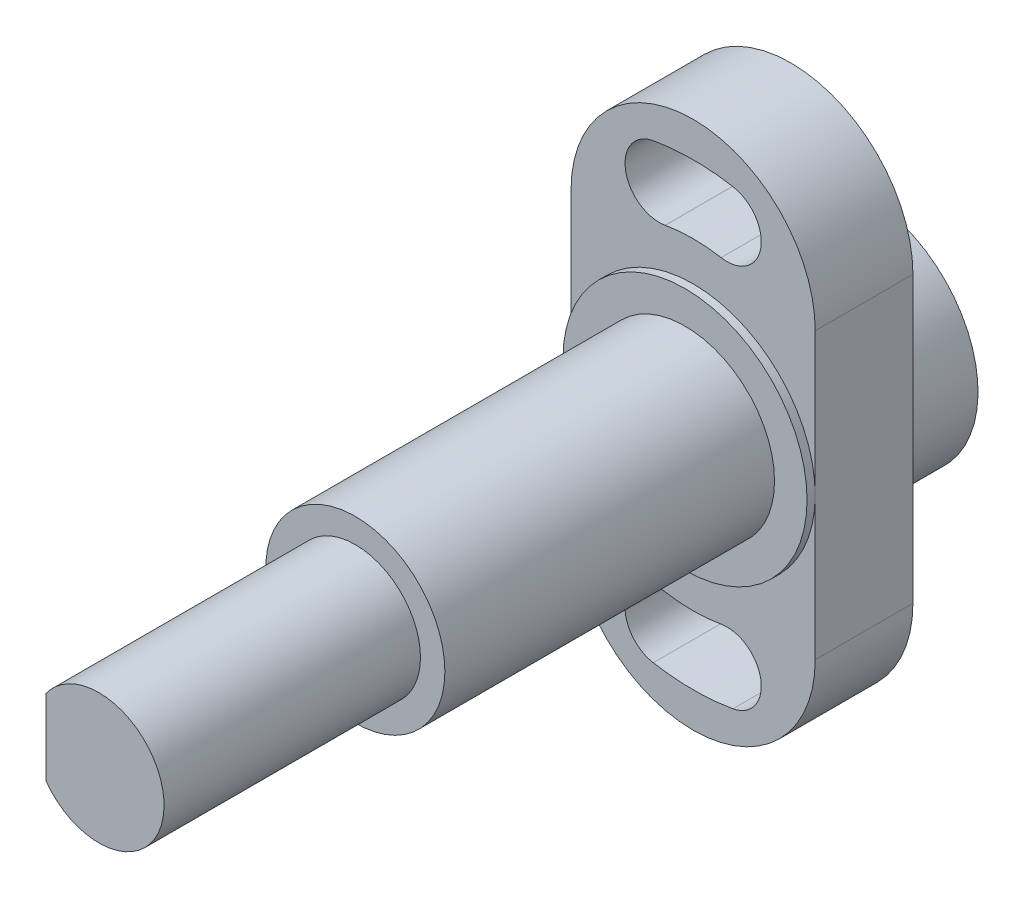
ISO-10303-21;
HEADER;
FILE_DESCRIPTION(('STEP AP214'),'2;1');
FILE_NAME('part.step','',(''),(''),'','','');
FILE_SCHEMA(('AUTOMOTIVE_DESIGN { 1 0 10303 214 1 1 1 1 }'));
ENDSEC;
DATA;
#1=APPLICATION_CONTEXT('core data for automotive mechanical design processes');
#2=APPLICATION_PROTOCOL_DEFINITION('international standard','automotive_design',2000,#1);
#3=PRODUCT_CONTEXT('',#1,'mechanical');
#4=PRODUCT('Part','Part','',(#3));
#5=PRODUCT_RELATED_PRODUCT_CATEGORY('part','',(#4));
#6=PRODUCT_DEFINITION_FORMATION('','',#4);
#7=PRODUCT_DEFINITION_CONTEXT('part definition',#1,'design');
#8=PRODUCT_DEFINITION('design','',#6,#7);
#9=PRODUCT_DEFINITION_SHAPE('','',#8);
#10=(LENGTH_UNIT() NAMED_UNIT(*) SI_UNIT(.MILLI.,.METRE.));
#11=(NAMED_UNIT(*) PLANE_ANGLE_UNIT() SI_UNIT($,.RADIAN.));
#12=(NAMED_UNIT(*) SI_UNIT($,.STERADIAN.) SOLID_ANGLE_UNIT());
#13=UNCERTAINTY_MEASURE_WITH_UNIT(LENGTH_MEASURE(1.E-05),#10,'distance_accuracy_value','');
#14=(GEOMETRIC_REPRESENTATION_CONTEXT(3) GLOBAL_UNCERTAINTY_ASSIGNED_CONTEXT((#13)) GLOBAL_UNIT_ASSIGNED_CONTEXT((#10,
#11,#12)) REPRESENTATION_CONTEXT('',''));
#15=CARTESIAN_POINT('',(0.,0.,0.));
#16=DIRECTION('',(0.,0.,1.));
#17=DIRECTION('',(1.,0.,0.));
#18=AXIS2_PLACEMENT_3D('',#15,#16,#17);
#19=CARTESIAN_POINT('',(0.,0.,-9.));
#20=DIRECTION('',(0.,0.,1.));
#21=DIRECTION('',(0.,-1.,0.));
#22=AXIS2_PLACEMENT_3D('',#19,#20,#21);
#23=CYLINDRICAL_SURFACE('',#22,28.2);
#24=DIRECTION('',(0.,0.,1.));
#25=VECTOR('',#24,1.);
#26=CARTESIAN_POINT('',(4.89687861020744,27.7715786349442,-9.));
#27=LINE('',#26,#25);
#28=CARTESIAN_POINT('',(4.89687861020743,27.7715786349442,0.));
#29=VERTEX_POINT('',#28);
#30=CARTESIAN_POINT('',(4.89687861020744,27.7715786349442,12.));
#31=VERTEX_POINT('',#30);
#32=EDGE_CURVE('E156',#29,#31,#27,.T.);
#33=ORIENTED_EDGE('',*,*,#32,.T.);
#34=CARTESIAN_POINT('',(0.,0.,12.));
#35=DIRECTION('',(0.,0.,1.));
#36=DIRECTION('',(0.,1.,0.));
#37=AXIS2_PLACEMENT_3D('',#34,#35,#36);
#38=CIRCLE('',#37,28.2);
#39=CARTESIAN_POINT('',(-4.89687861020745,27.7715786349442,12.));
#40=VERTEX_POINT('',#39);
#41=EDGE_CURVE('E230',#31,#40,#38,.T.);
#42=ORIENTED_EDGE('',*,*,#41,.T.);
#43=DIRECTION('',(0.,0.,1.));
#44=VECTOR('',#43,1.);
#45=CARTESIAN_POINT('',(-4.89687861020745,27.7715786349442,-9.));
#46=LINE('',#45,#44);
#47=CARTESIAN_POINT('',(-4.89687861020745,27.7715786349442,0.));
#48=VERTEX_POINT('',#47);
#49=EDGE_CURVE('E160',#48,#40,#46,.T.);
#50=ORIENTED_EDGE('',*,*,#49,.F.);
#51=CARTESIAN_POINT('',(0.,0.,0.));
#52=DIRECTION('',(0.,0.,1.));
#53=DIRECTION('',(-1.,0.,0.));
#54=AXIS2_PLACEMENT_3D('',#51,#52,#53);
#55=CIRCLE('',#54,28.2);
#56=EDGE_CURVE('E268',#29,#48,#55,.T.);
#57=ORIENTED_EDGE('',*,*,#56,.F.);
#58=EDGE_LOOP('',(#33,#42,#50,#57));
#59=FACE_BOUND('',#58,.T.);
#60=ADVANCED_FACE('F14',(#59),#23,.F.);
#61=CARTESIAN_POINT('',(-4.16755626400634,23.635386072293,-9.));
#62=DIRECTION('',(0.,0.,1.));
#63=DIRECTION('',(0.,-1.,0.));
#64=AXIS2_PLACEMENT_3D('',#61,#62,#63);
#65=CYLINDRICAL_SURFACE('',#64,4.2);
#66=ORIENTED_EDGE('',*,*,#49,.T.);
#67=CARTESIAN_POINT('',(-4.16755626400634,23.635386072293,12.));
#68=DIRECTION('',(0.,0.,1.));
#69=DIRECTION('',(0.,1.,0.));
#70=AXIS2_PLACEMENT_3D('',#67,#68,#69);
#71=CIRCLE('',#70,4.2);
#72=CARTESIAN_POINT('',(-3.43823391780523,19.4991935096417,12.));
#73=VERTEX_POINT('',#72);
#74=EDGE_CURVE('E227',#40,#73,#71,.T.);
#75=ORIENTED_EDGE('',*,*,#74,.T.);
#76=DIRECTION('',(0.,0.,1.));
#77=VECTOR('',#76,1.);
#78=CARTESIAN_POINT('',(-3.43823391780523,19.4991935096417,-9.));
#79=LINE('',#78,#77);
#80=CARTESIAN_POINT('',(-3.43823391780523,19.4991935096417,0.));
#81=VERTEX_POINT('',#80);
#82=EDGE_CURVE('E144',#81,#73,#79,.T.);
#83=ORIENTED_EDGE('',*,*,#82,.F.);
#84=CARTESIAN_POINT('',(-4.16755626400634,23.635386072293,0.));
#85=DIRECTION('',(0.,0.,1.));
#86=DIRECTION('',(-1.,0.,0.));
#87=AXIS2_PLACEMENT_3D('',#84,#85,#86);
#88=CIRCLE('',#87,4.2);
#89=EDGE_CURVE('E270',#48,#81,#88,.T.);
#90=ORIENTED_EDGE('',*,*,#89,.F.);
#91=EDGE_LOOP('',(#66,#75,#83,#90));
#92=FACE_BOUND('',#91,.T.);
#93=ADVANCED_FACE('F326',(#92),#65,.F.);
#94=CARTESIAN_POINT('',(0.,0.,-9.));
#95=DIRECTION('',(0.,0.,1.));
#96=DIRECTION('',(0.,-1.,0.));
#97=AXIS2_PLACEMENT_3D('',#94,#95,#96);
#98=CYLINDRICAL_SURFACE('',#97,19.8);
#99=ORIENTED_EDGE('',*,*,#82,.T.);
#100=CARTESIAN_POINT('',(0.,0.,12.));
#101=DIRECTION('',(0.,0.,1.));
#102=DIRECTION('',(0.,1.,0.));
#103=AXIS2_PLACEMENT_3D('',#100,#101,#102);
#104=CIRCLE('',#103,19.8);
#105=CARTESIAN_POINT('',(3.43823391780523,19.4991935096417,12.));
#106=VERTEX_POINT('',#105);
#107=EDGE_CURVE('E224',#73,#106,#104,.F.);
#108=ORIENTED_EDGE('',*,*,#107,.T.);
#109=DIRECTION('',(0.,0.,1.));
#110=VECTOR('',#109,1.);
#111=CARTESIAN_POINT('',(3.43823391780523,19.4991935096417,-9.));
#112=LINE('',#111,#110);
#113=CARTESIAN_POINT('',(3.43823391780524,19.4991935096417,0.));
#114=VERTEX_POINT('',#113);
#115=EDGE_CURVE('E141',#114,#106,#112,.T.);
#116=ORIENTED_EDGE('',*,*,#115,.F.);
#117=CARTESIAN_POINT('',(0.,0.,0.));
#118=DIRECTION('',(0.,0.,-1.));
#119=DIRECTION('',(-1.,0.,0.));
#120=AXIS2_PLACEMENT_3D('',#117,#118,#119);
#121=CIRCLE('',#120,19.8);
#122=EDGE_CURVE('E273',#81,#114,#121,.T.);
#123=ORIENTED_EDGE('',*,*,#122,.F.);
#124=EDGE_LOOP('',(#99,#108,#116,#123));
#125=FACE_BOUND('',#124,.T.);
#126=ADVANCED_FACE('F333',(#125),#98,.T.);
#127=CARTESIAN_POINT('',(4.16755626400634,23.635386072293,-9.));
#128=DIRECTION('',(0.,0.,1.));
#129=DIRECTION('',(0.,-1.,0.));
#130=AXIS2_PLACEMENT_3D('',#127,#128,#129);
#131=CYLINDRICAL_SURFACE('',#130,4.2);
#132=ORIENTED_EDGE('',*,*,#115,.T.);
#133=CARTESIAN_POINT('',(4.16755626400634,23.635386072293,12.));
#134=DIRECTION('',(0.,0.,1.));
#135=DIRECTION('',(0.,1.,0.));
#136=AXIS2_PLACEMENT_3D('',#133,#134,#135);
#137=CIRCLE('',#136,4.2);
#138=EDGE_CURVE('E233',#106,#31,#137,.T.);
#139=ORIENTED_EDGE('',*,*,#138,.T.);
#140=ORIENTED_EDGE('',*,*,#32,.F.);
#141=CARTESIAN_POINT('',(4.16755626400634,23.635386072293,0.));
#142=DIRECTION('',(0.,0.,1.));
#143=DIRECTION('',(-1.,0.,0.));
#144=AXIS2_PLACEMENT_3D('',#141,#142,#143);
#145=CIRCLE('',#144,4.2);
#146=EDGE_CURVE('E39',#114,#29,#145,.T.);
#147=ORIENTED_EDGE('',*,*,#146,.F.);
#148=EDGE_LOOP('',(#132,#139,#140,#147));
#149=FACE_BOUND('',#148,.T.);
#150=ADVANCED_FACE('F341',(#149),#131,.F.);
#151=CARTESIAN_POINT('',(0.,0.,-9.));
#152=DIRECTION('',(0.,0.,1.));
#153=DIRECTION('',(0.,-1.,0.));
#154=AXIS2_PLACEMENT_3D('',#151,#152,#153);
#155=CYLINDRICAL_SURFACE('',#154,28.2);
#156=DIRECTION('',(0.,0.,1.));
#157=VECTOR('',#156,1.);
#158=CARTESIAN_POINT('',(-4.89687861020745,-27.7715786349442,-9.));
#159=LINE('',#158,#157);
#160=CARTESIAN_POINT('',(-4.89687861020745,-27.7715786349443,0.));
#161=VERTEX_POINT('',#160);
#162=CARTESIAN_POINT('',(-4.89687861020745,-27.7715786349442,12.));
#163=VERTEX_POINT('',#162);
#164=EDGE_CURVE('E134',#161,#163,#159,.T.);
#165=ORIENTED_EDGE('',*,*,#164,.T.);
#166=CARTESIAN_POINT('',(0.,0.,12.));
#167=DIRECTION('',(0.,0.,1.));
#168=DIRECTION('',(0.,1.,0.));
#169=AXIS2_PLACEMENT_3D('',#166,#167,#168);
#170=CIRCLE('',#169,28.2);
#171=CARTESIAN_POINT('',(4.89687861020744,-27.7715786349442,12.));
#172=VERTEX_POINT('',#171);
#173=EDGE_CURVE('E23',#163,#172,#170,.T.);
#174=ORIENTED_EDGE('',*,*,#173,.T.);
#175=DIRECTION('',(0.,0.,1.));
#176=VECTOR('',#175,1.);
#177=CARTESIAN_POINT('',(4.89687861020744,-27.7715786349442,-9.));
#178=LINE('',#177,#176);
#179=CARTESIAN_POINT('',(4.89687861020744,-27.7715786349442,0.));
#180=VERTEX_POINT('',#179);
#181=EDGE_CURVE('E136',#180,#172,#178,.T.);
#182=ORIENTED_EDGE('',*,*,#181,.F.);
#183=CARTESIAN_POINT('',(0.,0.,0.));
#184=DIRECTION('',(0.,0.,1.));
#185=DIRECTION('',(-1.,0.,0.));
#186=AXIS2_PLACEMENT_3D('',#183,#184,#185);
#187=CIRCLE('',#186,28.2);
#188=EDGE_CURVE('E125',#161,#180,#187,.T.);
#189=ORIENTED_EDGE('',*,*,#188,.F.);
#190=EDGE_LOOP('',(#165,#174,#182,#189));
#191=FACE_BOUND('',#190,.T.);
#192=ADVANCED_FACE('F132',(#191),#155,.F.);
#193=CARTESIAN_POINT('',(4.16755626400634,-23.635386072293,-9.));
#194=DIRECTION('',(0.,0.,1.));
#195=DIRECTION('',(0.,-1.,0.));
#196=AXIS2_PLACEMENT_3D('',#193,#194,#195);
#197=CYLINDRICAL_SURFACE('',#196,4.2);
#198=ORIENTED_EDGE('',*,*,#181,.T.);
#199=CARTESIAN_POINT('',(4.16755626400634,-23.635386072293,12.));
#200=DIRECTION('',(0.,0.,1.));
#201=DIRECTION('',(0.,1.,0.));
#202=AXIS2_PLACEMENT_3D('',#199,#200,#201);
#203=CIRCLE('',#202,4.2);
#204=CARTESIAN_POINT('',(3.43823391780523,-19.4991935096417,12.));
#205=VERTEX_POINT('',#204);
#206=EDGE_CURVE('E238',#172,#205,#203,.T.);
#207=ORIENTED_EDGE('',*,*,#206,.T.);
#208=DIRECTION('',(0.,0.,1.));
#209=VECTOR('',#208,1.);
#210=CARTESIAN_POINT('',(3.43823391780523,-19.4991935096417,-9.));
#211=LINE('',#210,#209);
#212=CARTESIAN_POINT('',(3.43823391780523,-19.4991935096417,0.));
#213=VERTEX_POINT('',#212);
#214=EDGE_CURVE('E146',#213,#205,#211,.T.);
#215=ORIENTED_EDGE('',*,*,#214,.F.);
#216=CARTESIAN_POINT('',(4.16755626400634,-23.635386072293,0.));
#217=DIRECTION('',(0.,0.,1.));
#218=DIRECTION('',(-1.,0.,0.));
#219=AXIS2_PLACEMENT_3D('',#216,#217,#218);
#220=CIRCLE('',#219,4.2);
#221=EDGE_CURVE('E137',#180,#213,#220,.T.);
#222=ORIENTED_EDGE('',*,*,#221,.F.);
#223=EDGE_LOOP('',(#198,#207,#215,#222));
#224=FACE_BOUND('',#223,.T.);
#225=ADVANCED_FACE('F508',(#224),#197,.F.);
#226=CARTESIAN_POINT('',(0.,0.,-9.));
#227=DIRECTION('',(0.,0.,1.));
#228=DIRECTION('',(0.,-1.,0.));
#229=AXIS2_PLACEMENT_3D('',#226,#227,#228);
#230=CYLINDRICAL_SURFACE('',#229,19.8);
#231=ORIENTED_EDGE('',*,*,#214,.T.);
#232=CARTESIAN_POINT('',(0.,0.,12.));
#233=DIRECTION('',(0.,0.,1.));
#234=DIRECTION('',(0.,1.,0.));
#235=AXIS2_PLACEMENT_3D('',#232,#233,#234);
#236=CIRCLE('',#235,19.8);
#237=CARTESIAN_POINT('',(-3.43823391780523,-19.4991935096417,12.));
#238=VERTEX_POINT('',#237);
#239=EDGE_CURVE('E235',#205,#238,#236,.F.);
#240=ORIENTED_EDGE('',*,*,#239,.T.);
#241=DIRECTION('',(0.,0.,1.));
#242=VECTOR('',#241,1.);
#243=CARTESIAN_POINT('',(-3.43823391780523,-19.4991935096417,-9.));
#244=LINE('',#243,#242);
#245=CARTESIAN_POINT('',(-3.43823391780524,-19.4991935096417,0.));
#246=VERTEX_POINT('',#245);
#247=EDGE_CURVE('E154',#246,#238,#244,.T.);
#248=ORIENTED_EDGE('',*,*,#247,.F.);
#249=CARTESIAN_POINT('',(0.,0.,0.));
#250=DIRECTION('',(0.,0.,-1.));
#251=DIRECTION('',(-1.,0.,0.));
#252=AXIS2_PLACEMENT_3D('',#249,#250,#251);
#253=CIRCLE('',#252,19.8);
#254=EDGE_CURVE('E127',#213,#246,#253,.T.);
#255=ORIENTED_EDGE('',*,*,#254,.F.);
#256=EDGE_LOOP('',(#231,#240,#248,#255));
#257=FACE_BOUND('',#256,.T.);
#258=ADVANCED_FACE('F501',(#257),#230,.T.);
#259=CARTESIAN_POINT('',(-4.16755626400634,-23.635386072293,-9.));
#260=DIRECTION('',(0.,0.,1.));
#261=DIRECTION('',(0.,-1.,0.));
#262=AXIS2_PLACEMENT_3D('',#259,#260,#261);
#263=CYLINDRICAL_SURFACE('',#262,4.2);
#264=ORIENTED_EDGE('',*,*,#247,.T.);
#265=CARTESIAN_POINT('',(-4.16755626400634,-23.635386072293,12.));
#266=DIRECTION('',(0.,0.,1.));
#267=DIRECTION('',(0.,1.,0.));
#268=AXIS2_PLACEMENT_3D('',#265,#266,#267);
#269=CIRCLE('',#268,4.2);
#270=EDGE_CURVE('E9',#238,#163,#269,.T.);
#271=ORIENTED_EDGE('',*,*,#270,.T.);
#272=ORIENTED_EDGE('',*,*,#164,.F.);
#273=CARTESIAN_POINT('',(-4.16755626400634,-23.635386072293,0.));
#274=DIRECTION('',(0.,0.,1.));
#275=DIRECTION('',(-1.,0.,0.));
#276=AXIS2_PLACEMENT_3D('',#273,#274,#275);
#277=CIRCLE('',#276,4.2);
#278=EDGE_CURVE('E31',#246,#161,#277,.T.);
#279=ORIENTED_EDGE('',*,*,#278,.F.);
#280=EDGE_LOOP('',(#264,#271,#272,#279));
#281=FACE_BOUND('',#280,.T.);
#282=ADVANCED_FACE('F139',(#281),#263,.F.);
#283=CARTESIAN_POINT('',(-11.,0.,13.));
#284=DIRECTION('',(0.,0.,1.));
#285=DIRECTION('',(0.,-1.,0.));
#286=AXIS2_PLACEMENT_3D('',#283,#284,#285);
#287=PLANE('',#286);
#288=CARTESIAN_POINT('',(0.,0.,13.));
#289=DIRECTION('',(0.,0.,-1.));
#290=DIRECTION('',(0.,-1.,0.));
#291=AXIS2_PLACEMENT_3D('',#288,#289,#290);
#292=CIRCLE('',#291,11.);
#293=CARTESIAN_POINT('',(0.,-11.,13.));
#294=VERTEX_POINT('',#293);
#295=EDGE_CURVE('E211',#294,#294,#292,.F.);
#296=ORIENTED_EDGE('',*,*,#295,.F.);
#297=EDGE_LOOP('',(#296));
#298=FACE_BOUND('',#297,.T.);
#299=CARTESIAN_POINT('',(0.,0.,13.));
#300=DIRECTION('',(0.,0.,1.));
#301=DIRECTION('',(0.,1.,0.));
#302=AXIS2_PLACEMENT_3D('',#299,#300,#301);
#303=CIRCLE('',#302,14.995);
#304=CARTESIAN_POINT('',(0.,14.995,13.));
#305=VERTEX_POINT('',#304);
#306=EDGE_CURVE('E208',#305,#305,#303,.T.);
#307=ORIENTED_EDGE('',*,*,#306,.T.);
#308=EDGE_LOOP('',(#307));
#309=FACE_BOUND('',#308,.T.);
#310=ADVANCED_FACE('F411',(#298,#309),#287,.T.);
#311=CARTESIAN_POINT('',(-15.,-10.,6.));
#312=DIRECTION('',(-1.,0.,0.));
#313=DIRECTION('',(0.,1.,0.));
#314=AXIS2_PLACEMENT_3D('',#311,#312,#313);
#315=CONICAL_SURFACE('',#314,2.65,0.78539816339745);
#316=CARTESIAN_POINT('',(-14.85,-10.,6.));
#317=DIRECTION('',(-1.,0.,0.));
#318=DIRECTION('',(0.,0.,1.));
#319=AXIS2_PLACEMENT_3D('',#316,#317,#318);
#320=CIRCLE('',#319,2.5);
#321=CARTESIAN_POINT('',(-14.85,-10.,8.5));
#322=VERTEX_POINT('',#321);
#323=EDGE_CURVE('E252',#322,#322,#320,.F.);
#324=ORIENTED_EDGE('',*,*,#323,.T.);
#325=EDGE_LOOP('',(#324));
#326=FACE_BOUND('',#325,.T.);
#327=CARTESIAN_POINT('',(-15.,-10.,6.));
#328=DIRECTION('',(1.,0.,0.));
#329=DIRECTION('',(0.,1.,0.));
#330=AXIS2_PLACEMENT_3D('',#327,#328,#329);
#331=CIRCLE('',#330,2.65);
#332=CARTESIAN_POINT('',(-15.,-7.35,6.));
#333=VERTEX_POINT('',#332);
#334=EDGE_CURVE('E290',#333,#333,#331,.T.);
#335=ORIENTED_EDGE('',*,*,#334,.F.);
#336=EDGE_LOOP('',(#335));
#337=FACE_BOUND('',#336,.T.);
#338=ADVANCED_FACE('F409',(#326,#337),#315,.F.);
#339=CARTESIAN_POINT('',(0.,0.,0.));
#340=DIRECTION('',(0.,0.,-1.));
#341=DIRECTION('',(0.,1.,0.));
#342=AXIS2_PLACEMENT_3D('',#339,#340,#341);
#343=CYLINDRICAL_SURFACE('',#342,14.995);
#344=ORIENTED_EDGE('',*,*,#306,.F.);
#345=EDGE_LOOP('',(#344));
#346=FACE_BOUND('',#345,.T.);
#347=CARTESIAN_POINT('',(0.,0.,12.));
#348=DIRECTION('',(0.,0.,-1.));
#349=DIRECTION('',(0.,-1.,0.));
#350=AXIS2_PLACEMENT_3D('',#347,#348,#349);
#351=CIRCLE('',#350,14.995);
#352=CARTESIAN_POINT('',(0.,-14.995,12.));
#353=VERTEX_POINT('',#352);
#354=EDGE_CURVE('E182',#353,#353,#351,.T.);
#355=ORIENTED_EDGE('',*,*,#354,.F.);
#356=EDGE_LOOP('',(#355));
#357=FACE_BOUND('',#356,.T.);
#358=ADVANCED_FACE('F395',(#346,#357),#343,.T.);
#359=CARTESIAN_POINT('',(15.,17.5,12.));
#360=DIRECTION('',(-1.,0.,0.));
#361=DIRECTION('',(0.,1.,0.));
#362=AXIS2_PLACEMENT_3D('',#359,#360,#361);
#363=PLANE('',#362);
#364=DIRECTION('',(0.,1.,0.));
#365=VECTOR('',#364,1.);
#366=CARTESIAN_POINT('',(15.,-17.5,0.));
#367=LINE('',#366,#365);
#368=CARTESIAN_POINT('',(15.,-17.5,0.));
#369=VERTEX_POINT('',#368);
#370=CARTESIAN_POINT('',(15.,17.5,0.));
#371=VERTEX_POINT('',#370);
#372=EDGE_CURVE('E280',#369,#371,#367,.T.);
#373=ORIENTED_EDGE('',*,*,#372,.T.);
#374=DIRECTION('',(0.,0.,-1.));
#375=VECTOR('',#374,1.);
#376=CARTESIAN_POINT('',(15.,17.5,12.));
#377=LINE('',#376,#375);
#378=CARTESIAN_POINT('',(15.,17.5,12.));
#379=VERTEX_POINT('',#378);
#380=EDGE_CURVE('E199',#379,#371,#377,.T.);
#381=ORIENTED_EDGE('',*,*,#380,.F.);
#382=DIRECTION('',(0.,-1.,0.));
#383=VECTOR('',#382,1.);
#384=CARTESIAN_POINT('',(15.,17.5,12.));
#385=LINE('',#384,#383);
#386=CARTESIAN_POINT('',(15.,-17.5,12.));
#387=VERTEX_POINT('',#386);
#388=EDGE_CURVE('E193',#379,#387,#385,.T.);
#389=ORIENTED_EDGE('',*,*,#388,.T.);
#390=DIRECTION('',(0.,0.,-1.));
#391=VECTOR('',#390,1.);
#392=CARTESIAN_POINT('',(15.,-17.5,12.));
#393=LINE('',#392,#391);
#394=EDGE_CURVE('E196',#387,#369,#393,.T.);
#395=ORIENTED_EDGE('',*,*,#394,.T.);
#396=EDGE_LOOP('',(#373,#381,#389,#395));
#397=FACE_BOUND('',#396,.T.);
#398=ADVANCED_FACE('F391',(#397),#363,.F.);
#399=CARTESIAN_POINT('',(0.,-17.5,12.));
#400=DIRECTION('',(0.,0.,-1.));
#401=DIRECTION('',(0.,1.,0.));
#402=AXIS2_PLACEMENT_3D('',#399,#400,#401);
#403=CYLINDRICAL_SURFACE('',#402,15.);
#404=CARTESIAN_POINT('',(0.,-17.5,0.));
#405=DIRECTION('',(0.,0.,1.));
#406=DIRECTION('',(-1.,0.,0.));
#407=AXIS2_PLACEMENT_3D('',#404,#405,#406);
#408=CIRCLE('',#407,15.);
#409=CARTESIAN_POINT('',(-15.,-17.5,0.));
#410=VERTEX_POINT('',#409);
#411=EDGE_CURVE('E278',#410,#369,#408,.T.);
#412=ORIENTED_EDGE('',*,*,#411,.T.);
#413=ORIENTED_EDGE('',*,*,#394,.F.);
#414=CARTESIAN_POINT('',(0.,-17.5,12.));
#415=DIRECTION('',(0.,0.,-1.));
#416=DIRECTION('',(0.,1.,0.));
#417=AXIS2_PLACEMENT_3D('',#414,#415,#416);
#418=CIRCLE('',#417,15.);
#419=CARTESIAN_POINT('',(-15.,-17.5,12.));
#420=VERTEX_POINT('',#419);
#421=EDGE_CURVE('E185',#387,#420,#418,.T.);
#422=ORIENTED_EDGE('',*,*,#421,.T.);
#423=DIRECTION('',(0.,0.,-1.));
#424=VECTOR('',#423,1.);
#425=CARTESIAN_POINT('',(-15.,-17.5,12.));
#426=LINE('',#425,#424);
#427=EDGE_CURVE('E205',#420,#410,#426,.T.);
#428=ORIENTED_EDGE('',*,*,#427,.T.);
#429=EDGE_LOOP('',(#412,#413,#422,#428));
#430=FACE_BOUND('',#429,.T.);
#431=ADVANCED_FACE('F394',(#430),#403,.T.);
#432=CARTESIAN_POINT('',(-15.,17.5,12.));
#433=DIRECTION('',(1.,0.,0.));
#434=DIRECTION('',(0.,-1.,0.));
#435=AXIS2_PLACEMENT_3D('',#432,#433,#434);
#436=PLANE('',#435);
#437=DIRECTION('',(0.,-1.,0.));
#438=VECTOR('',#437,1.);
#439=CARTESIAN_POINT('',(-15.,17.5,0.));
#440=LINE('',#439,#438);
#441=CARTESIAN_POINT('',(-15.,17.5,0.));
#442=VERTEX_POINT('',#441);
#443=EDGE_CURVE('E285',#442,#410,#440,.T.);
#444=ORIENTED_EDGE('',*,*,#443,.T.);
#445=ORIENTED_EDGE('',*,*,#427,.F.);
#446=DIRECTION('',(0.,1.,0.));
#447=VECTOR('',#446,1.);
#448=CARTESIAN_POINT('',(-15.,17.5,12.));
#449=LINE('',#448,#447);
#450=CARTESIAN_POINT('',(-15.,17.5,12.));
#451=VERTEX_POINT('',#450);
#452=EDGE_CURVE('E188',#420,#451,#449,.T.);
#453=ORIENTED_EDGE('',*,*,#452,.T.);
#454=DIRECTION('',(0.,0.,-1.));
#455=VECTOR('',#454,1.);
#456=CARTESIAN_POINT('',(-15.,17.5,12.));
#457=LINE('',#456,#455);
#458=EDGE_CURVE('E202',#451,#442,#457,.T.);
#459=ORIENTED_EDGE('',*,*,#458,.T.);
#460=EDGE_LOOP('',(#444,#445,#453,#459));
#461=FACE_BOUND('',#460,.T.);
#462=ORIENTED_EDGE('',*,*,#334,.T.);
#463=EDGE_LOOP('',(#462));
#464=FACE_BOUND('',#463,.T.);
#465=ADVANCED_FACE('F399',(#461,#464),#436,.F.);
#466=CARTESIAN_POINT('',(0.,17.5,12.));
#467=DIRECTION('',(0.,0.,-1.));
#468=DIRECTION('',(0.,1.,0.));
#469=AXIS2_PLACEMENT_3D('',#466,#467,#468);
#470=CYLINDRICAL_SURFACE('',#469,15.);
#471=CARTESIAN_POINT('',(0.,17.5,0.));
#472=DIRECTION('',(0.,0.,1.));
#473=DIRECTION('',(-1.,0.,0.));
#474=AXIS2_PLACEMENT_3D('',#471,#472,#473);
#475=CIRCLE('',#474,15.);
#476=EDGE_CURVE('E283',#371,#442,#475,.T.);
#477=ORIENTED_EDGE('',*,*,#476,.T.);
#478=ORIENTED_EDGE('',*,*,#458,.F.);
#479=CARTESIAN_POINT('',(0.,17.5,12.));
#480=DIRECTION('',(0.,0.,-1.));
#481=DIRECTION('',(0.,-1.,0.));
#482=AXIS2_PLACEMENT_3D('',#479,#480,#481);
#483=CIRCLE('',#482,15.);
#484=EDGE_CURVE('E191',#451,#379,#483,.T.);
#485=ORIENTED_EDGE('',*,*,#484,.T.);
#486=ORIENTED_EDGE('',*,*,#380,.T.);
#487=EDGE_LOOP('',(#477,#478,#485,#486));
#488=FACE_BOUND('',#487,.T.);
#489=ADVANCED_FACE('F389',(#488),#470,.T.);
#490=CARTESIAN_POINT('',(0.,-17.5,12.));
#491=DIRECTION('',(0.,0.,-1.));
#492=DIRECTION('',(0.,1.,0.));
#493=AXIS2_PLACEMENT_3D('',#490,#491,#492);
#494=PLANE('',#493);
#495=ORIENTED_EDGE('',*,*,#239,.F.);
#496=ORIENTED_EDGE('',*,*,#206,.F.);
#497=ORIENTED_EDGE('',*,*,#173,.F.);
#498=ORIENTED_EDGE('',*,*,#270,.F.);
#499=EDGE_LOOP('',(#495,#496,#497,#498));
#500=FACE_BOUND('',#499,.T.);
#501=ORIENTED_EDGE('',*,*,#107,.F.);
#502=ORIENTED_EDGE('',*,*,#74,.F.);
#503=ORIENTED_EDGE('',*,*,#41,.F.);
#504=ORIENTED_EDGE('',*,*,#138,.F.);
#505=EDGE_LOOP('',(#501,#502,#503,#504));
#506=FACE_BOUND('',#505,.T.);
#507=ORIENTED_EDGE('',*,*,#421,.F.);
#508=ORIENTED_EDGE('',*,*,#388,.F.);
#509=ORIENTED_EDGE('',*,*,#484,.F.);
#510=ORIENTED_EDGE('',*,*,#452,.F.);
#511=EDGE_LOOP('',(#507,#508,#509,#510));
#512=FACE_BOUND('',#511,.T.);
#513=ORIENTED_EDGE('',*,*,#354,.T.);
#514=EDGE_LOOP('',(#513));
#515=FACE_BOUND('',#514,.T.);
#516=ADVANCED_FACE('F353',(#500,#506,#512,#515),#494,.F.);
#517=CARTESIAN_POINT('',(-8.,0.,-9.));
#518=DIRECTION('',(0.,0.,-1.));
#519=DIRECTION('',(0.,1.,0.));
#520=AXIS2_PLACEMENT_3D('',#517,#518,#519);
#521=PLANE('',#520);
#522=CARTESIAN_POINT('',(0.,0.,-9.));
#523=DIRECTION('',(0.,0.,1.));
#524=DIRECTION('',(0.,1.,0.));
#525=AXIS2_PLACEMENT_3D('',#522,#523,#524);
#526=CIRCLE('',#525,14.);
#527=CARTESIAN_POINT('',(0.,14.,-9.));
#528=VERTEX_POINT('',#527);
#529=EDGE_CURVE('E159',#528,#528,#526,.T.);
#530=ORIENTED_EDGE('',*,*,#529,.F.);
#531=EDGE_LOOP('',(#530));
#532=FACE_BOUND('',#531,.T.);
#533=ADVANCED_FACE('F349',(#532),#521,.T.);
#534=CARTESIAN_POINT('',(0.,0.,0.));
#535=DIRECTION('',(0.,0.,-1.));
#536=DIRECTION('',(0.,1.,0.));
#537=AXIS2_PLACEMENT_3D('',#534,#535,#536);
#538=CYLINDRICAL_SURFACE('',#537,14.);
#539=CARTESIAN_POINT('',(0.,0.,0.));
#540=DIRECTION('',(0.,0.,1.));
#541=DIRECTION('',(0.,1.,0.));
#542=AXIS2_PLACEMENT_3D('',#539,#540,#541);
#543=CIRCLE('',#542,14.);
#544=CARTESIAN_POINT('',(0.,14.,0.));
#545=VERTEX_POINT('',#544);
#546=EDGE_CURVE('E221',#545,#545,#543,.T.);
#547=ORIENTED_EDGE('',*,*,#546,.F.);
#548=EDGE_LOOP('',(#547));
#549=FACE_BOUND('',#548,.T.);
#550=ORIENTED_EDGE('',*,*,#529,.T.);
#551=EDGE_LOOP('',(#550));
#552=FACE_BOUND('',#551,.T.);
#553=ADVANCED_FACE('F346',(#549,#552),#538,.T.);
#554=CARTESIAN_POINT('',(-8.,0.,0.));
#555=DIRECTION('',(0.,0.,-1.));
#556=DIRECTION('',(0.,1.,0.));
#557=AXIS2_PLACEMENT_3D('',#554,#555,#556);
#558=PLANE('',#557);
#559=ORIENTED_EDGE('',*,*,#254,.T.);
#560=ORIENTED_EDGE('',*,*,#278,.T.);
#561=ORIENTED_EDGE('',*,*,#188,.T.);
#562=ORIENTED_EDGE('',*,*,#221,.T.);
#563=EDGE_LOOP('',(#559,#560,#561,#562));
#564=FACE_BOUND('',#563,.T.);
#565=ORIENTED_EDGE('',*,*,#146,.T.);
#566=ORIENTED_EDGE('',*,*,#56,.T.);
#567=ORIENTED_EDGE('',*,*,#89,.T.);
#568=ORIENTED_EDGE('',*,*,#122,.T.);
#569=EDGE_LOOP('',(#565,#566,#567,#568));
#570=FACE_BOUND('',#569,.T.);
#571=ORIENTED_EDGE('',*,*,#546,.T.);
#572=EDGE_LOOP('',(#571));
#573=FACE_BOUND('',#572,.T.);
#574=ORIENTED_EDGE('',*,*,#411,.F.);
#575=ORIENTED_EDGE('',*,*,#443,.F.);
#576=ORIENTED_EDGE('',*,*,#476,.F.);
#577=ORIENTED_EDGE('',*,*,#372,.F.);
#578=EDGE_LOOP('',(#574,#575,#576,#577));
#579=FACE_BOUND('',#578,.T.);
#580=ADVANCED_FACE('F16',(#564,#570,#573,#579),#558,.T.);
#581=CARTESIAN_POINT('',(0.,0.,0.));
#582=DIRECTION('',(0.,0.,-1.));
#583=DIRECTION('',(0.,1.,0.));
#584=AXIS2_PLACEMENT_3D('',#581,#582,#583);
#585=CYLINDRICAL_SURFACE('',#584,11.);
#586=ORIENTED_EDGE('',*,*,#295,.T.);
#587=EDGE_LOOP('',(#586));
#588=FACE_BOUND('',#587,.T.);
#589=CARTESIAN_POINT('',(0.,0.,53.5));
#590=DIRECTION('',(0.,0.,-1.));
#591=DIRECTION('',(1.,0.,0.));
#592=AXIS2_PLACEMENT_3D('',#589,#590,#591);
#593=CIRCLE('',#592,11.);
#594=CARTESIAN_POINT('',(11.,0.,53.5));
#595=VERTEX_POINT('',#594);
#596=EDGE_CURVE('E287',#595,#595,#593,.T.);
#597=ORIENTED_EDGE('',*,*,#596,.T.);
#598=EDGE_LOOP('',(#597));
#599=FACE_BOUND('',#598,.T.);
#600=ADVANCED_FACE('F359',(#588,#599),#585,.T.);
#601=CARTESIAN_POINT('',(-6.5,0.,81.));
#602=DIRECTION('',(-1.,0.,0.));
#603=DIRECTION('',(0.,1.,0.));
#604=AXIS2_PLACEMENT_3D('',#601,#602,#603);
#605=CONICAL_SURFACE('',#604,2.65,0.785398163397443);
#606=CARTESIAN_POINT('',(-6.35,0.,81.));
#607=DIRECTION('',(-1.,0.,0.));
#608=DIRECTION('',(0.,0.,1.));
#609=AXIS2_PLACEMENT_3D('',#606,#607,#608);
#610=CIRCLE('',#609,2.5);
#611=CARTESIAN_POINT('',(-6.35,0.,83.5));
#612=VERTEX_POINT('',#611);
#613=EDGE_CURVE('E246',#612,#612,#610,.F.);
#614=ORIENTED_EDGE('',*,*,#613,.T.);
#615=EDGE_LOOP('',(#614));
#616=FACE_BOUND('',#615,.T.);
#617=CARTESIAN_POINT('',(-6.5,0.,81.));
#618=DIRECTION('',(1.,0.,0.));
#619=DIRECTION('',(0.,1.,0.));
#620=AXIS2_PLACEMENT_3D('',#617,#618,#619);
#621=CIRCLE('',#620,2.65);
#622=CARTESIAN_POINT('',(-6.5,2.65,81.));
#623=VERTEX_POINT('',#622);
#624=EDGE_CURVE('E167',#623,#623,#621,.T.);
#625=ORIENTED_EDGE('',*,*,#624,.F.);
#626=EDGE_LOOP('',(#625));
#627=FACE_BOUND('',#626,.T.);
#628=ADVANCED_FACE('F355',(#616,#627),#605,.F.);
#629=CARTESIAN_POINT('',(-6.5,10.,75.));
#630=DIRECTION('',(0.500000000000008,0.,-0.866025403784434));
#631=DIRECTION('',(-0.866025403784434,0.,-0.500000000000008));
#632=AXIS2_PLACEMENT_3D('',#629,#630,#631);
#633=PLANE('',#632);
#634=CARTESIAN_POINT('',(0.,0.,78.7527767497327));
#635=DIRECTION('',(-0.500000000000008,0.,0.866025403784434));
#636=DIRECTION('',(-0.866025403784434,0.,-0.500000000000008));
#637=AXIS2_PLACEMENT_3D('',#634,#635,#636);
#638=ELLIPSE('',#637,9.23760430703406,8.);
#639=CARTESIAN_POINT('',(-6.5,4.66368952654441,75.));
#640=VERTEX_POINT('',#639);
#641=CARTESIAN_POINT('',(-6.5,-4.6636895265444,75.));
#642=VERTEX_POINT('',#641);
#643=EDGE_CURVE('E214',#640,#642,#638,.T.);
#644=ORIENTED_EDGE('',*,*,#643,.T.);
#645=DIRECTION('',(0.,-1.,0.));
#646=VECTOR('',#645,1.);
#647=CARTESIAN_POINT('',(-6.5,10.,75.));
#648=LINE('',#647,#646);
#649=EDGE_CURVE('E173',#640,#642,#648,.T.);
#650=ORIENTED_EDGE('',*,*,#649,.F.);
#651=EDGE_LOOP('',(#644,#650));
#652=FACE_BOUND('',#651,.T.);
#653=ADVANCED_FACE('F358',(#652),#633,.F.);
#654=CARTESIAN_POINT('',(0.,0.,85.));
#655=DIRECTION('',(0.,0.,1.));
#656=DIRECTION('',(0.,-1.,0.));
#657=AXIS2_PLACEMENT_3D('',#654,#655,#656);
#658=PLANE('',#657);
#659=DIRECTION('',(0.,-1.,0.));
#660=VECTOR('',#659,1.);
#661=CARTESIAN_POINT('',(-6.5,10.,85.));
#662=LINE('',#661,#660);
#663=CARTESIAN_POINT('',(-6.5,4.6636895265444,85.));
#664=VERTEX_POINT('',#663);
#665=CARTESIAN_POINT('',(-6.5,-4.6636895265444,85.));
#666=VERTEX_POINT('',#665);
#667=EDGE_CURVE('E174',#664,#666,#662,.T.);
#668=ORIENTED_EDGE('',*,*,#667,.T.);
#669=CARTESIAN_POINT('',(0.,0.,85.));
#670=DIRECTION('',(0.,0.,-1.));
#671=DIRECTION('',(1.,0.,0.));
#672=AXIS2_PLACEMENT_3D('',#669,#670,#671);
#673=CIRCLE('',#672,8.);
#674=EDGE_CURVE('E275',#664,#666,#673,.T.);
#675=ORIENTED_EDGE('',*,*,#674,.F.);
#676=EDGE_LOOP('',(#668,#675));
#677=FACE_BOUND('',#676,.T.);
#678=ADVANCED_FACE('F372',(#677),#658,.T.);
#679=CARTESIAN_POINT('',(-6.5,10.,85.));
#680=DIRECTION('',(1.,0.,0.));
#681=DIRECTION('',(0.,0.,-1.));
#682=AXIS2_PLACEMENT_3D('',#679,#680,#681);
#683=PLANE('',#682);
#684=ORIENTED_EDGE('',*,*,#667,.F.);
#685=DIRECTION('',(0.,0.,-1.));
#686=VECTOR('',#685,1.);
#687=CARTESIAN_POINT('',(-6.5,4.6636895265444,0.));
#688=LINE('',#687,#686);
#689=EDGE_CURVE('E219',#664,#640,#688,.T.);
#690=ORIENTED_EDGE('',*,*,#689,.T.);
#691=ORIENTED_EDGE('',*,*,#649,.T.);
#692=DIRECTION('',(0.,0.,-1.));
#693=VECTOR('',#692,1.);
#694=CARTESIAN_POINT('',(-6.5,-4.6636895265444,0.));
#695=LINE('',#694,#693);
#696=EDGE_CURVE('E217',#642,#666,#695,.F.);
#697=ORIENTED_EDGE('',*,*,#696,.T.);
#698=EDGE_LOOP('',(#684,#690,#691,#697));
#699=FACE_BOUND('',#698,.T.);
#700=ORIENTED_EDGE('',*,*,#624,.T.);
#701=EDGE_LOOP('',(#700));
#702=FACE_BOUND('',#701,.T.);
#703=ADVANCED_FACE('F374',(#699,#702),#683,.F.);
#704=CARTESIAN_POINT('',(0.,0.,0.));
#705=DIRECTION('',(0.,0.,-1.));
#706=DIRECTION('',(0.,1.,0.));
#707=AXIS2_PLACEMENT_3D('',#704,#705,#706);
#708=CYLINDRICAL_SURFACE('',#707,8.);
#709=ORIENTED_EDGE('',*,*,#696,.F.);
#710=ORIENTED_EDGE('',*,*,#643,.F.);
#711=ORIENTED_EDGE('',*,*,#689,.F.);
#712=ORIENTED_EDGE('',*,*,#674,.T.);
#713=EDGE_LOOP('',(#709,#710,#711,#712));
#714=FACE_BOUND('',#713,.T.);
#715=CARTESIAN_POINT('',(0.,0.,53.5));
#716=DIRECTION('',(0.,0.,1.));
#717=DIRECTION('',(0.,1.,0.));
#718=AXIS2_PLACEMENT_3D('',#715,#716,#717);
#719=CIRCLE('',#718,8.);
#720=CARTESIAN_POINT('',(0.,8.,53.5));
#721=VERTEX_POINT('',#720);
#722=EDGE_CURVE('E177',#721,#721,#719,.T.);
#723=ORIENTED_EDGE('',*,*,#722,.T.);
#724=EDGE_LOOP('',(#723));
#725=FACE_BOUND('',#724,.T.);
#726=ADVANCED_FACE('F377',(#714,#725),#708,.T.);
#727=CARTESIAN_POINT('',(-11.,0.,53.5));
#728=DIRECTION('',(0.,0.,-1.));
#729=DIRECTION('',(0.,1.,0.));
#730=AXIS2_PLACEMENT_3D('',#727,#728,#729);
#731=PLANE('',#730);
#732=ORIENTED_EDGE('',*,*,#722,.F.);
#733=EDGE_LOOP('',(#732));
#734=FACE_BOUND('',#733,.T.);
#735=ORIENTED_EDGE('',*,*,#596,.F.);
#736=EDGE_LOOP('',(#735));
#737=FACE_BOUND('',#736,.T.);
#738=ADVANCED_FACE('F381',(#734,#737),#731,.F.);
#739=CARTESIAN_POINT('',(-2.5,0.,81.));
#740=DIRECTION('',(-1.,0.,0.));
#741=DIRECTION('',(0.,0.,1.));
#742=AXIS2_PLACEMENT_3D('',#739,#740,#741);
#743=PLANE('',#742);
#744=CARTESIAN_POINT('',(-2.5,0.,81.));
#745=DIRECTION('',(-1.,0.,0.));
#746=DIRECTION('',(0.,0.,1.));
#747=AXIS2_PLACEMENT_3D('',#744,#745,#746);
#748=CIRCLE('',#747,2.5);
#749=CARTESIAN_POINT('',(-2.5,0.,83.5));
#750=VERTEX_POINT('',#749);
#751=EDGE_CURVE('E250',#750,#750,#748,.T.);
#752=ORIENTED_EDGE('',*,*,#751,.T.);
#753=EDGE_LOOP('',(#752));
#754=FACE_BOUND('',#753,.T.);
#755=CARTESIAN_POINT('',(-2.5,0.,81.));
#756=DIRECTION('',(-1.,0.,0.));
#757=DIRECTION('',(0.,0.,1.));
#758=AXIS2_PLACEMENT_3D('',#755,#756,#757);
#759=CIRCLE('',#758,2.1);
#760=CARTESIAN_POINT('',(-2.5,0.,83.1));
#761=VERTEX_POINT('',#760);
#762=EDGE_CURVE('E249',#761,#761,#759,.F.);
#763=ORIENTED_EDGE('',*,*,#762,.T.);
#764=EDGE_LOOP('',(#763));
#765=FACE_BOUND('',#764,.T.);
#766=ADVANCED_FACE('F385',(#754,#765),#743,.T.);
#767=CARTESIAN_POINT('',(-2.5,0.,81.));
#768=DIRECTION('',(-1.,0.,0.));
#769=DIRECTION('',(0.,0.,1.));
#770=AXIS2_PLACEMENT_3D('',#767,#768,#769);
#771=CYLINDRICAL_SURFACE('',#770,2.5);
#772=ORIENTED_EDGE('',*,*,#751,.F.);
#773=EDGE_LOOP('',(#772));
#774=FACE_BOUND('',#773,.T.);
#775=ORIENTED_EDGE('',*,*,#613,.F.);
#776=EDGE_LOOP('',(#775));
#777=FACE_BOUND('',#776,.T.);
#778=ADVANCED_FACE('F368',(#774,#777),#771,.F.);
#779=CARTESIAN_POINT('',(2.5,0.,81.));
#780=DIRECTION('',(-1.,0.,0.));
#781=DIRECTION('',(0.,1.,0.));
#782=AXIS2_PLACEMENT_3D('',#779,#780,#781);
#783=CONICAL_SURFACE('',#782,2.1,1.02974425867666);
#784=CARTESIAN_POINT('',(3.76180729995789,0.,81.));
#785=VERTEX_POINT('',#784);
#786=VERTEX_LOOP('',#785);
#787=FACE_BOUND('',#786,.T.);
#788=CARTESIAN_POINT('',(2.5,0.,81.));
#789=DIRECTION('',(1.,0.,0.));
#790=DIRECTION('',(0.,1.,0.));
#791=AXIS2_PLACEMENT_3D('',#788,#789,#790);
#792=CIRCLE('',#791,2.1);
#793=CARTESIAN_POINT('',(2.5,2.1,81.));
#794=VERTEX_POINT('',#793);
#795=EDGE_CURVE('E170',#794,#794,#792,.T.);
#796=ORIENTED_EDGE('',*,*,#795,.F.);
#797=EDGE_LOOP('',(#796));
#798=FACE_BOUND('',#797,.T.);
#799=ADVANCED_FACE('F364',(#787,#798),#783,.F.);
#800=CARTESIAN_POINT('',(-6.5,0.,81.));
#801=DIRECTION('',(-1.,0.,0.));
#802=DIRECTION('',(0.,1.,0.));
#803=AXIS2_PLACEMENT_3D('',#800,#801,#802);
#804=CYLINDRICAL_SURFACE('',#803,2.1);
#805=ORIENTED_EDGE('',*,*,#795,.T.);
#806=EDGE_LOOP('',(#805));
#807=FACE_BOUND('',#806,.T.);
#808=ORIENTED_EDGE('',*,*,#762,.F.);
#809=EDGE_LOOP('',(#808));
#810=FACE_BOUND('',#809,.T.);
#811=ADVANCED_FACE('F361',(#807,#810),#804,.F.);
#812=CARTESIAN_POINT('',(-11.,-10.,6.));
#813=DIRECTION('',(-1.,0.,0.));
#814=DIRECTION('',(0.,0.,1.));
#815=AXIS2_PLACEMENT_3D('',#812,#813,#814);
#816=PLANE('',#815);
#817=CARTESIAN_POINT('',(-11.,-10.,6.));
#818=DIRECTION('',(-1.,0.,0.));
#819=DIRECTION('',(0.,0.,1.));
#820=AXIS2_PLACEMENT_3D('',#817,#818,#819);
#821=CIRCLE('',#820,2.5);
#822=CARTESIAN_POINT('',(-11.,-10.,8.5));
#823=VERTEX_POINT('',#822);
#824=EDGE_CURVE('E254',#823,#823,#821,.T.);
#825=ORIENTED_EDGE('',*,*,#824,.T.);
#826=EDGE_LOOP('',(#825));
#827=FACE_BOUND('',#826,.T.);
#828=CARTESIAN_POINT('',(-11.,-10.,6.));
#829=DIRECTION('',(-1.,0.,0.));
#830=DIRECTION('',(0.,0.,1.));
#831=AXIS2_PLACEMENT_3D('',#828,#829,#830);
#832=CIRCLE('',#831,2.1);
#833=CARTESIAN_POINT('',(-11.,-10.,8.1));
#834=VERTEX_POINT('',#833);
#835=EDGE_CURVE('E18',#834,#834,#832,.F.);
#836=ORIENTED_EDGE('',*,*,#835,.T.);
#837=EDGE_LOOP('',(#836));
#838=FACE_BOUND('',#837,.T.);
#839=ADVANCED_FACE('F321',(#827,#838),#816,.T.);
#840=CARTESIAN_POINT('',(-11.,-10.,6.));
#841=DIRECTION('',(-1.,0.,0.));
#842=DIRECTION('',(0.,0.,1.));
#843=AXIS2_PLACEMENT_3D('',#840,#841,#842);
#844=CYLINDRICAL_SURFACE('',#843,2.5);
#845=ORIENTED_EDGE('',*,*,#824,.F.);
#846=EDGE_LOOP('',(#845));
#847=FACE_BOUND('',#846,.T.);
#848=ORIENTED_EDGE('',*,*,#323,.F.);
#849=EDGE_LOOP('',(#848));
#850=FACE_BOUND('',#849,.T.);
#851=ADVANCED_FACE('F313',(#847,#850),#844,.F.);
#852=CARTESIAN_POINT('',(1.,-10.,6.));
#853=DIRECTION('',(-1.,0.,0.));
#854=DIRECTION('',(0.,1.,0.));
#855=AXIS2_PLACEMENT_3D('',#852,#853,#854);
#856=CONICAL_SURFACE('',#855,0.75,1.02974425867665);
#857=CARTESIAN_POINT('',(1.45064546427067,-10.,6.));
#858=VERTEX_POINT('',#857);
#859=VERTEX_LOOP('',#858);
#860=FACE_BOUND('',#859,.T.);
#861=CARTESIAN_POINT('',(1.,-10.,6.));
#862=DIRECTION('',(1.,0.,0.));
#863=DIRECTION('',(0.,1.,0.));
#864=AXIS2_PLACEMENT_3D('',#861,#862,#863);
#865=CIRCLE('',#864,0.75);
#866=CARTESIAN_POINT('',(1.,-9.25,6.));
#867=VERTEX_POINT('',#866);
#868=EDGE_CURVE('E149',#867,#867,#865,.T.);
#869=ORIENTED_EDGE('',*,*,#868,.F.);
#870=EDGE_LOOP('',(#869));
#871=FACE_BOUND('',#870,.T.);
#872=ADVANCED_FACE('F307',(#860,#871),#856,.F.);
#873=CARTESIAN_POINT('',(-15.,-10.,6.));
#874=DIRECTION('',(-1.,0.,0.));
#875=DIRECTION('',(0.,1.,0.));
#876=AXIS2_PLACEMENT_3D('',#873,#874,#875);
#877=CYLINDRICAL_SURFACE('',#876,0.75);
#878=CARTESIAN_POINT('',(-8.18883816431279,-10.,6.));
#879=DIRECTION('',(1.,0.,0.));
#880=DIRECTION('',(0.,1.,0.));
#881=AXIS2_PLACEMENT_3D('',#878,#879,#880);
#882=CIRCLE('',#881,0.75);
#883=CARTESIAN_POINT('',(-8.18883816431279,-9.25,6.));
#884=VERTEX_POINT('',#883);
#885=EDGE_CURVE('E242',#884,#884,#882,.T.);
#886=ORIENTED_EDGE('',*,*,#885,.F.);
#887=EDGE_LOOP('',(#886));
#888=FACE_BOUND('',#887,.T.);
#889=ORIENTED_EDGE('',*,*,#868,.T.);
#890=EDGE_LOOP('',(#889));
#891=FACE_BOUND('',#890,.T.);
#892=ADVANCED_FACE('F301',(#888,#891),#877,.F.);
#893=CARTESIAN_POINT('',(-9.,-10.,6.));
#894=DIRECTION('',(-1.,0.,0.));
#895=DIRECTION('',(0.,1.,0.));
#896=AXIS2_PLACEMENT_3D('',#893,#894,#895);
#897=CONICAL_SURFACE('',#896,2.1,1.02974425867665);
#898=CARTESIAN_POINT('',(-9.,-10.,6.));
#899=DIRECTION('',(1.,0.,0.));
#900=DIRECTION('',(0.,1.,0.));
#901=AXIS2_PLACEMENT_3D('',#898,#899,#900);
#902=CIRCLE('',#901,2.1);
#903=CARTESIAN_POINT('',(-9.,-7.9,6.));
#904=VERTEX_POINT('',#903);
#905=EDGE_CURVE('E245',#904,#904,#902,.T.);
#906=ORIENTED_EDGE('',*,*,#905,.F.);
#907=EDGE_LOOP('',(#906));
#908=FACE_BOUND('',#907,.T.);
#909=ORIENTED_EDGE('',*,*,#885,.T.);
#910=EDGE_LOOP('',(#909));
#911=FACE_BOUND('',#910,.T.);
#912=ADVANCED_FACE('F298',(#908,#911),#897,.F.);
#913=CARTESIAN_POINT('',(-15.,-10.,6.));
#914=DIRECTION('',(-1.,0.,0.));
#915=DIRECTION('',(0.,1.,0.));
#916=AXIS2_PLACEMENT_3D('',#913,#914,#915);
#917=CYLINDRICAL_SURFACE('',#916,2.1);
#918=ORIENTED_EDGE('',*,*,#905,.T.);
#919=EDGE_LOOP('',(#918));
#920=FACE_BOUND('',#919,.T.);
#921=ORIENTED_EDGE('',*,*,#835,.F.);
#922=EDGE_LOOP('',(#921));
#923=FACE_BOUND('',#922,.T.);
#924=ADVANCED_FACE('F295',(#920,#923),#917,.F.);
#925=CLOSED_SHELL('',(#60,#93,#126,#150,#192,#225,#258,#282,#310,#338,#358,#398,#431,#465,#489,
#516,#533,#553,#580,#600,#628,#653,#678,#703,#726,#738,#766,#778,#799,#811,#839,#851,#872,#892,
#912,#924));
#926=MANIFOLD_SOLID_BREP('B1',#925);
#927=ADVANCED_BREP_SHAPE_REPRESENTATION('',(#18,#926),#14);
#928=SHAPE_DEFINITION_REPRESENTATION(#9,#927);
ENDSEC;
END-ISO-10303-21;
